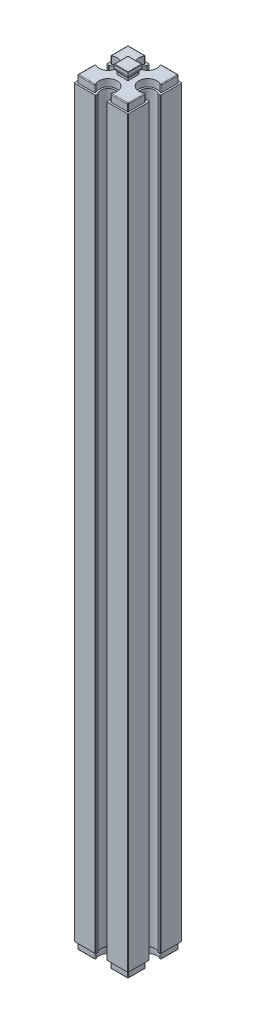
from build123d import *

# Parameters (mm, degrees)
EXTRUDE_1_DEPTH     = 103
EXTRUDE_2_DEPTH     = 2
EXTRUDE_3_DEPTH     = 2
CUT_EXTRUDE_1_DEPTH = 2.5
FILLET_1_R          = 0.1
FILLET_2_R          = 0.2
FILLET_3_R          = 0.2


with BuildPart() as part:
    # Sketch 1 → Extrude 1 (new body)
    with BuildSketch(Plane(origin=(0, 0, 0), x_dir=(1, 0, 0), z_dir=(0, 1, 0))):
        with BuildLine():
            Line((-7.5, 7.5), (-1.5, 7.5))
            Line((-1.5, 7.5), (-1.5, 6.822875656))
            ThreePointArc((-1.5, 6.822875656), (0, 3.5), (1.5, 6.822875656))
            Line((1.5, 6.822875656), (1.5, 7.5))
            Line((1.5, 7.5), (7.5, 7.5))
            Line((7.5, 7.5), (7.5, 1.5))
            Line((7.5, 1.5), (6.822875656, 1.5))
            ThreePointArc((6.822875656, 1.5), (3.5, 0), (6.822875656, -1.5))
            Line((6.822875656, -1.5), (7.5, -1.5))
            Line((7.5, -1.5), (7.5, -7.5))
            Line((7.5, -7.5), (1.5, -7.5))
            Line((1.5, -7.5), (1.5, -6.822875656))
            ThreePointArc((1.5, -6.822875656), (0, -3.5), (-1.5, -6.822875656))
            Line((-1.5, -6.822875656), (-1.5, -7.5))
            Line((-1.5, -7.5), (-7.5, -7.5))
            Line((-7.5, -7.5), (-7.5, -1.5))
            Line((-7.5, -1.5), (-6.822875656, -1.5))
            ThreePointArc((-6.822875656, -1.5), (-3.5, 0), (-6.822875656, 1.5))
            Line((-6.822875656, 1.5), (-7.5, 1.5))
            Line((-7.5, 1.5), (-7.5, 7.5))
        make_face()
    extrude_1 = extrude(amount=EXTRUDE_1_DEPTH)

    # Sketch 2 → Extrude 2 (add)
    with BuildSketch(Plane(origin=(0, 103, 0), x_dir=(1, 0, 0), z_dir=(0, 1, 0))):
        with BuildLine():
            Line((-7, 7), (-7, 2))
            ThreePointArc((-7, 2), (-3, 0), (-7, -2))
            Line((-7, -2), (-7, -7))
            Line((-7, -7), (-2, -7))
            ThreePointArc((-2, -7), (0, -3), (2, -7))
            Line((2, -7), (7, -7))
            Line((7, -7), (7, -2))
            ThreePointArc((7, -2), (3, 0), (7, 2))
            Line((7, 2), (7, 7))
            Line((7, 7), (2, 7))
            ThreePointArc((2, 7), (0, 3), (-2, 7))
            Line((-2, 7), (-7, 7))
        make_face()
    extrude_2 = extrude(amount=EXTRUDE_2_DEPTH)

    # Sketch 3 → Extrude 3 (add, symmetric)
    with BuildSketch(Plane(origin=(0, 0, 0), x_dir=(0, 0, -1), z_dir=(1, 0, 0))):
        with BuildLine():
            Line((-1.5, 105), (1.5, 105))
            Line((1.5, 105), (1.5, 105.677124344))
            ThreePointArc((1.5, 105.677124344), (1.780042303, 106.088161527), (1.95, 106.555590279))
            Line((1.95, 106.555590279), (1.95, 107.5))
            Line((1.95, 107.5), (-1.95, 107.5))
            Line((-1.95, 107.5), (-1.95, 106.555590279))
            ThreePointArc((-1.95, 106.555590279), (-1.780042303, 106.088161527), (-1.5, 105.677124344))
            Line((-1.5, 105.677124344), (-1.5, 105))
        make_face()
    extrude_3 = extrude(amount=EXTRUDE_3_DEPTH, both=True)

    # Sketch 4 → Cut-Extrude 1 (cut, symmetric)
    with BuildSketch(Plane.XY):
        with BuildLine():
            Line((1.5, 105), (1.5, 105.677124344))
            ThreePointArc((1.5, 105.677124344), (1.780042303, 106.088161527), (1.95, 106.555590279))
            Line((1.95, 106.555590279), (1.95, 107.5))
            Line((1.95, 107.5), (2.5, 107.5))
            Line((2.5, 107.5), (2.5, 105))
            Line((2.5, 105), (1.5, 105))
        make_face()
        with BuildLine():
            Line((-1.5, 105), (-1.5, 105.677124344))
            ThreePointArc((-1.5, 105.677124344), (-1.780042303, 106.088161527), (-1.95, 106.555590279))
            Line((-1.95, 106.555590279), (-1.95, 107.5))
            Line((-1.95, 107.5), (-2.5, 107.5))
            Line((-2.5, 107.5), (-2.5, 105))
            Line((-2.5, 105), (-1.5, 105))
        make_face()
    cut_extrude_1 = extrude(amount=CUT_EXTRUDE_1_DEPTH, both=True, mode=Mode.SUBTRACT)

    # Mirror 1: Extrude 1, Extrude 2, Extrude 3, Cut-Extrude 1 across plane
    add(extrude_1.mirror(Plane.ZX))
    add(extrude_2.mirror(Plane.ZX))
    add(extrude_3.mirror(Plane.ZX))
    add(cut_extrude_1.mirror(Plane.ZX), mode=Mode.SUBTRACT)

    # Fillet 1
    fillet_1_edges = [part.edges().sort_by_distance(p)[0] for p in [
        (0, 107.5, -1.95),
        (0, 107.5, 1.95),
        (-1.95, 107.5, 0),
        (1.95, 107.5, 0),
        (0, -107.5, 1.95),
        (0, -107.5, -1.95),
        (-1.95, -107.5, 0),
        (1.95, -107.5, 0),
    ]]
    fillet(fillet_1_edges, radius=FILLET_1_R)

    # Fillet 2
    fillet_2_edges = [part.edges().sort_by_distance(p)[0] for p in [
        (-4.5, -105, -7),
        (-7, -104, -7),
        (-2, -104, -7),
        (4.5, -105, -7),
        (2, -104, -7),
        (7, -105, -4.5),
        (7, -104, -7),
        (7, -104, -2),
        (7, -105, 4.5),
        (7, -104, 2),
        (4.5, -105, 7),
        (7, -104, 7),
        (2, -104, 7),
        (-4.5, -105, 7),
        (-2, -104, 7),
        (-7, -105, 4.5),
        (-7, -104, 7),
        (-7, -104, 2),
        (-7, -105, -4.5),
        (-7, -104, -2),
        (-2, 104, -7),
        (-7, 104, -7),
        (-7, 104, -2),
        (-7, 104, 2),
        (-7, 104, 7),
        (-2, 104, 7),
        (2, 104, 7),
        (7, 104, 7),
        (7, 104, 2),
        (7, 104, -2),
        (7, 104, -7),
        (2, 104, -7),
        (-4.5, 105, -7),
        (-7, 105, -4.5),
        (-7, 105, 4.5),
        (-4.5, 105, 7),
        (4.5, 105, 7),
        (7, 105, 4.5),
        (7, 105, -4.5),
        (4.5, 105, -7),
    ]]
    fillet(fillet_2_edges, radius=FILLET_2_R)

    # Fillet 3
    fillet_3_edges = [part.edges().sort_by_distance(p)[0] for p in [
        (-7.5, 0, -7.5),
        (-1.5, 0, -7.5),
        (1.5, 0, -7.5),
        (7.5, 0, -7.5),
        (7.5, 0, -1.5),
        (7.5, 0, 1.5),
        (7.5, 0, 7.5),
        (1.5, 0, 7.5),
        (-1.5, 0, 7.5),
        (-7.5, 0, 7.5),
        (-7.5, 0, 1.5),
        (-6.822875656, 0, -1.5),
        (-7.5, 0, -1.5),
    ]]
    fillet(fillet_3_edges, radius=FILLET_3_R)


solid = part.part
